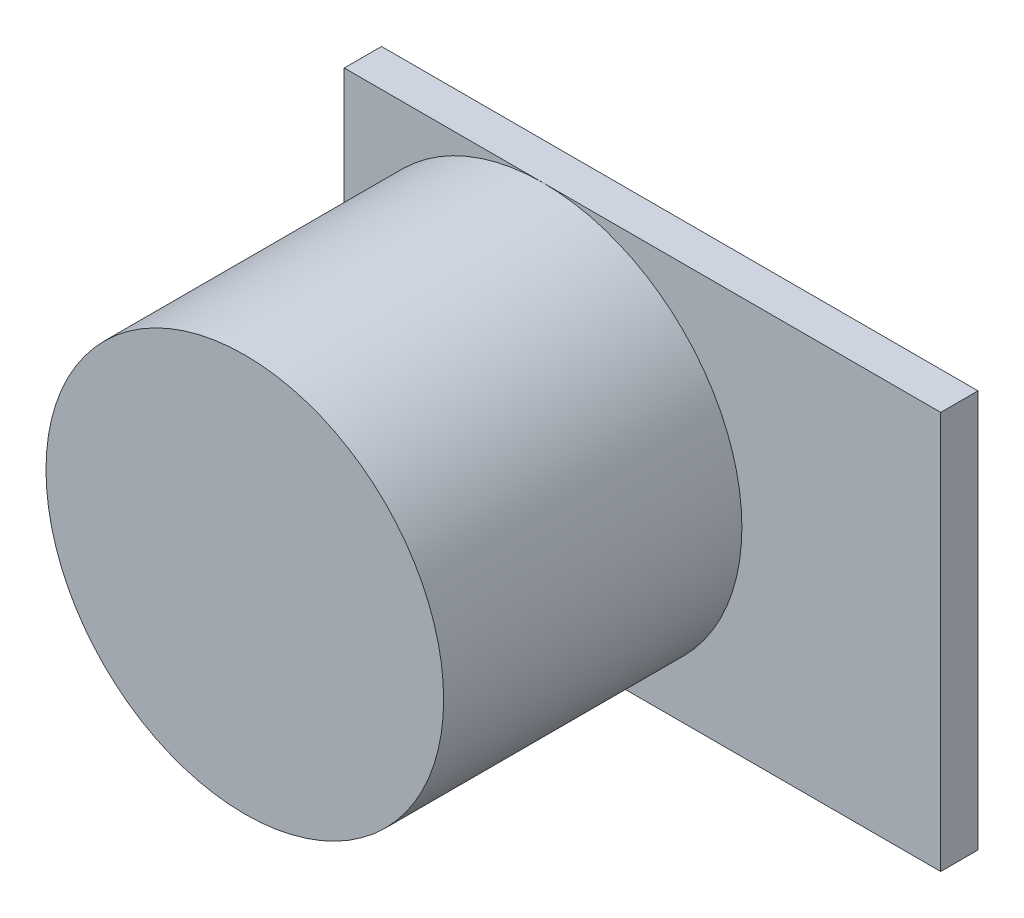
from build123d import *

# Parameters (mm, degrees)
SKIZZE1_R               = 80
LINEAR_AUSTRAGEN1_DEPTH = 120
SKIZZE2_W               = 240
SKIZZE2_H               = 160
LINEAR_AUSTRAGEN2_DEPTH = 15


with BuildPart() as part:
    # Skizze1 → Linear austragen1 (new body)
    with BuildSketch(Plane.XY):
        Circle(SKIZZE1_R)
    extrude(amount=LINEAR_AUSTRAGEN1_DEPTH)

    # Skizze2 → Linear austragen2 (add)
    with BuildSketch(Plane(origin=(0, 0, 0), x_dir=(-1, 0, 0), z_dir=(0, 0, -1))):
        with Locations((-40, 0)):
            Rectangle(SKIZZE2_W, SKIZZE2_H)
    extrude(amount=LINEAR_AUSTRAGEN2_DEPTH)


solid = part.part
